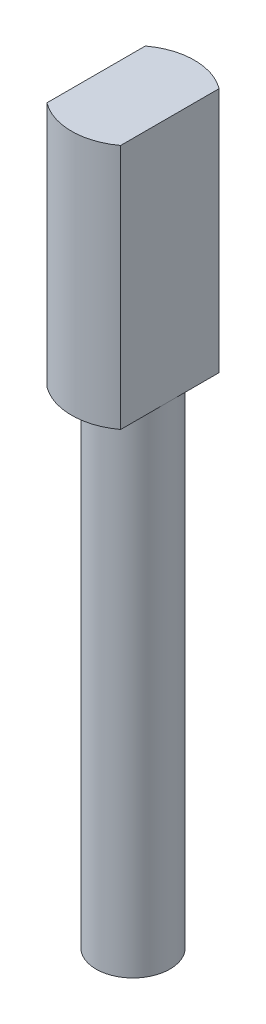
from build123d import *

# Parameters (mm, degrees)
SKETCH1_R      = 3
EXTRUDE1_DEPTH = 60
SKETCH2_R      = 1.5
EXTRUDE2_DEPTH = 4.5
SKETCH3_R      = 5
EXTRUDE3_DEPTH = 20
SKETCH4_W      = 2.799661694
SKETCH4_H      = 10
SKETCH4_W_2    = 2.679676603
EXTRUDE4_DEPTH = 20


with BuildPart() as part:
    # Sketch1 → Extrude1 (new body)
    with BuildSketch(Plane(origin=(0, 0, 0), x_dir=(1, 0, 0), z_dir=(0, 1, 0))):
        with Locations(Location((0, 0, 0), (0, 0, 270))):
            Circle(SKETCH1_R)
    extrude(amount=EXTRUDE1_DEPTH)

    # Sketch2 → Extrude2 (cut)
    with BuildSketch(Plane.XZ):
        with Locations(Location((0, 0, 0), (0, 0, 270))):
            Circle(SKETCH2_R)
    extrude(amount=-EXTRUDE2_DEPTH, mode=Mode.SUBTRACT)

    # Sketch3 → Extrude3 (add)
    with BuildSketch(Plane(origin=(0, 60, 0), x_dir=(1, 0, 0), z_dir=(0, 1, 0))):
        with Locations(Location((0, 0, 0), (0, 0, 270))):
            Circle(SKETCH3_R)
    extrude(amount=-EXTRUDE3_DEPTH)

    # Sketch4 → Extrude4 (cut)
    with BuildSketch(Plane(origin=(0, 60, 0), x_dir=(1, 0, 0), z_dir=(0, 1, 0))):
        with Locations((-4.399830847, 0)):
            Rectangle(SKETCH4_W, SKETCH4_H)
        with Locations((4.339838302, 0)):
            Rectangle(SKETCH4_W_2, SKETCH4_H)
    extrude(amount=-EXTRUDE4_DEPTH, mode=Mode.SUBTRACT)


solid = part.part
